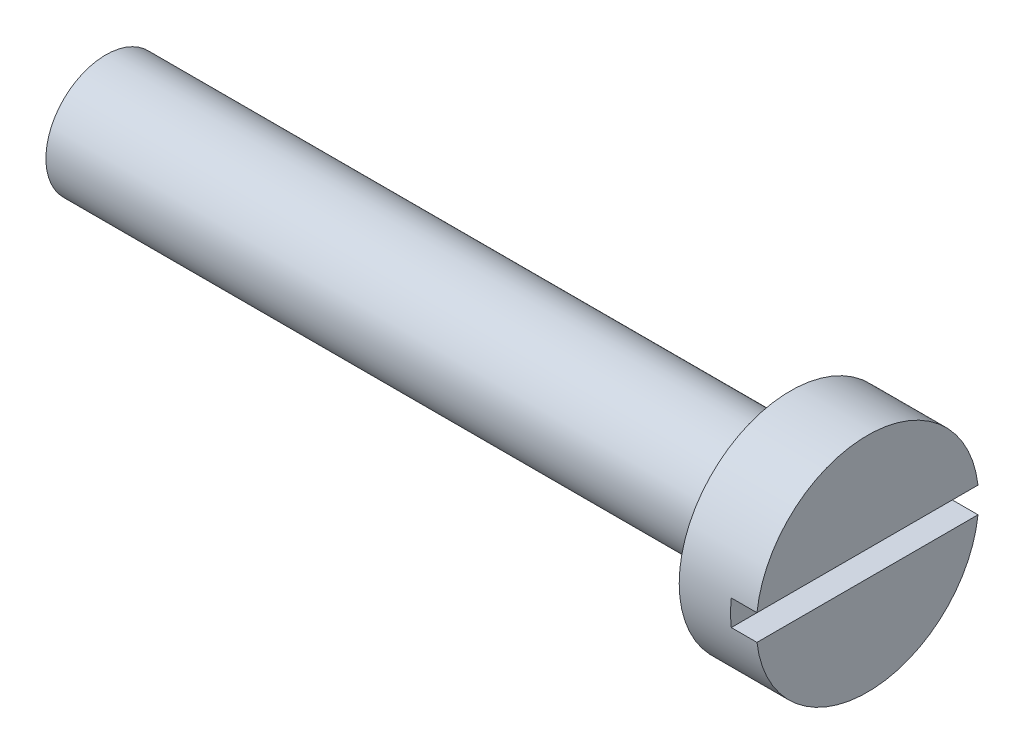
from build123d import *

# Parameters (mm, degrees)
ENL_V_MAT_EXTRU_1_DEPTH      = 10.087904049
ENL_V_MAT_EXTRU_1_DEPTH_BACK = 10.087904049
ESQUISSE2_W                  = 0.3
ESQUISSE2_H                  = 0.3


with BuildPart() as part:
    # Esquisse1 → R_volution1 (revolve)
    with BuildSketch(Plane.XY, mode=Mode.PRIVATE) as r_volution1_sk:
        Polygon((0, 0), (0, 1.3), (-0.9, 1.3), (-0.9, 0.7), (-8.9, 0.7), (-8.9, 0), align=None)
    revolve(r_volution1_sk.sketch.rotate(Axis((0, 0, 0), (-1, 0, 0)), 90), axis=Axis((0, 0, 0), (-1, 0, 0)))

    # Esquisse2 → Enl_v. mat.-Extru.1 (cut, two sides: drawn at the far end of the back side and taken through both)
    with BuildSketch(Plane.XY.offset(-ENL_V_MAT_EXTRU_1_DEPTH_BACK)):
        with Locations((-0.15, 0)):
            Rectangle(ESQUISSE2_W, ESQUISSE2_H)
    extrude(amount=ENL_V_MAT_EXTRU_1_DEPTH + ENL_V_MAT_EXTRU_1_DEPTH_BACK, mode=Mode.SUBTRACT)


solid = part.part
